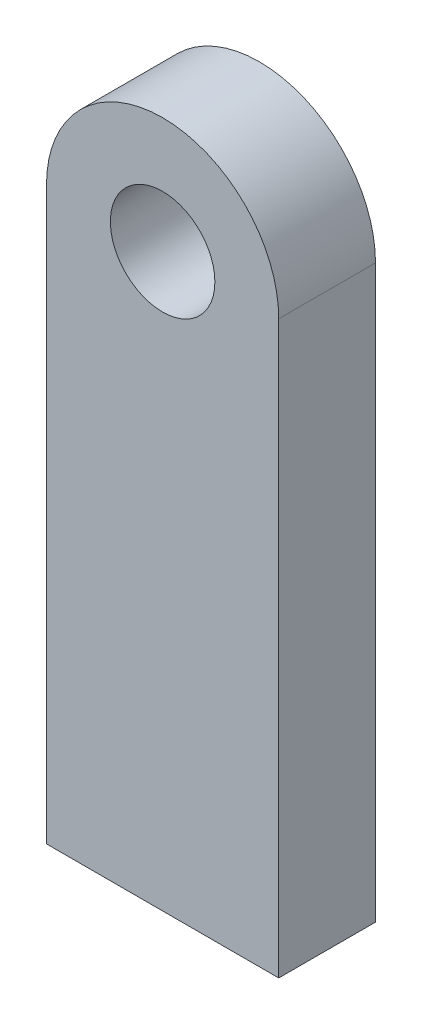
from build123d import *

# Parameters (mm, degrees)
SKETCH1_R           = 3.429
BOSS_EXTRUDE1_DEPTH = 6.35


with BuildPart() as part:
    # Sketch1 → Boss-Extrude1 (new body)
    with BuildSketch(Plane.XY):
        with BuildLine():
            Line((0, 0), (15.24, 0))
            Line((15.24, 0), (15.24, 37.465))
            ThreePointArc((15.24, 37.465), (7.62, 45.085), (0, 37.465))
            Line((0, 37.465), (0, 0))
        make_face()
        with Locations((7.62, 37.465)):
            Circle(SKETCH1_R, mode=Mode.SUBTRACT)
    extrude(amount=BOSS_EXTRUDE1_DEPTH)


solid = part.part
